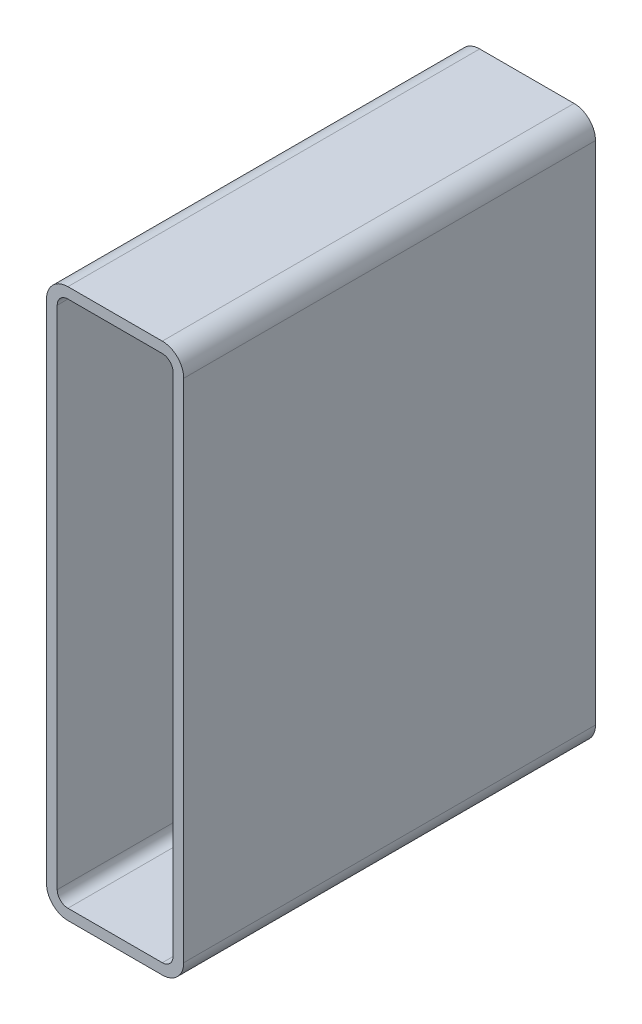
ISO-10303-21;
HEADER;
FILE_DESCRIPTION(('STEP AP214'),'2;1');
FILE_NAME('part.step','',(''),(''),'','','');
FILE_SCHEMA(('AUTOMOTIVE_DESIGN { 1 0 10303 214 1 1 1 1 }'));
ENDSEC;
DATA;
#1=APPLICATION_CONTEXT('core data for automotive mechanical design processes');
#2=APPLICATION_PROTOCOL_DEFINITION('international standard','automotive_design',2000,#1);
#3=PRODUCT_CONTEXT('',#1,'mechanical');
#4=PRODUCT('Part','Part','',(#3));
#5=PRODUCT_RELATED_PRODUCT_CATEGORY('part','',(#4));
#6=PRODUCT_DEFINITION_FORMATION('','',#4);
#7=PRODUCT_DEFINITION_CONTEXT('part definition',#1,'design');
#8=PRODUCT_DEFINITION('design','',#6,#7);
#9=PRODUCT_DEFINITION_SHAPE('','',#8);
#10=(LENGTH_UNIT() NAMED_UNIT(*) SI_UNIT(.MILLI.,.METRE.));
#11=(NAMED_UNIT(*) PLANE_ANGLE_UNIT() SI_UNIT($,.RADIAN.));
#12=(NAMED_UNIT(*) SI_UNIT($,.STERADIAN.) SOLID_ANGLE_UNIT());
#13=UNCERTAINTY_MEASURE_WITH_UNIT(LENGTH_MEASURE(1.E-05),#10,'distance_accuracy_value','');
#14=(GEOMETRIC_REPRESENTATION_CONTEXT(3) GLOBAL_UNCERTAINTY_ASSIGNED_CONTEXT((#13)) GLOBAL_UNIT_ASSIGNED_CONTEXT((#10,
#11,#12)) REPRESENTATION_CONTEXT('',''));
#15=CARTESIAN_POINT('',(0.,0.,0.));
#16=DIRECTION('',(0.,0.,1.));
#17=DIRECTION('',(1.,0.,0.));
#18=AXIS2_PLACEMENT_3D('',#15,#16,#17);
#19=CARTESIAN_POINT('',(17.5501778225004,392.307862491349,304.8));
#20=DIRECTION('',(0.,0.,1.));
#21=DIRECTION('',(1.,0.,0.));
#22=AXIS2_PLACEMENT_3D('',#19,#20,#21);
#23=PLANE('',#22);
#24=CARTESIAN_POINT('',(17.5501778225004,392.307862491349,304.8));
#25=DIRECTION('',(0.,0.,1.));
#26=DIRECTION('',(1.,0.,0.));
#27=AXIS2_PLACEMENT_3D('',#24,#25,#26);
#28=CIRCLE('',#27,15.875);
#29=CARTESIAN_POINT('',(17.5501778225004,408.182862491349,304.8));
#30=VERTEX_POINT('',#29);
#31=CARTESIAN_POINT('',(1.67517782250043,392.307862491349,304.8));
#32=VERTEX_POINT('',#31);
#33=EDGE_CURVE('E211',#30,#32,#28,.T.);
#34=ORIENTED_EDGE('',*,*,#33,.T.);
#35=DIRECTION('',(0.,-1.,0.));
#36=VECTOR('',#35,1.);
#37=CARTESIAN_POINT('',(1.67517782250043,17.6578624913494,304.8));
#38=LINE('',#37,#36);
#39=CARTESIAN_POINT('',(1.67517782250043,17.6578624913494,304.8));
#40=VERTEX_POINT('',#39);
#41=EDGE_CURVE('E214',#32,#40,#38,.T.);
#42=ORIENTED_EDGE('',*,*,#41,.T.);
#43=CARTESIAN_POINT('',(17.5501778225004,17.6578624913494,304.8));
#44=DIRECTION('',(0.,0.,1.));
#45=DIRECTION('',(1.,0.,0.));
#46=AXIS2_PLACEMENT_3D('',#43,#44,#45);
#47=CIRCLE('',#46,15.875);
#48=CARTESIAN_POINT('',(17.5501778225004,1.78286249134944,304.8));
#49=VERTEX_POINT('',#48);
#50=EDGE_CURVE('E217',#40,#49,#47,.T.);
#51=ORIENTED_EDGE('',*,*,#50,.T.);
#52=DIRECTION('',(1.,0.,0.));
#53=VECTOR('',#52,1.);
#54=CARTESIAN_POINT('',(87.4001778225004,1.78286249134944,304.8));
#55=LINE('',#54,#53);
#56=CARTESIAN_POINT('',(87.4001778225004,1.78286249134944,304.8));
#57=VERTEX_POINT('',#56);
#58=EDGE_CURVE('E219',#49,#57,#55,.T.);
#59=ORIENTED_EDGE('',*,*,#58,.T.);
#60=CARTESIAN_POINT('',(87.4001778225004,17.6578624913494,304.8));
#61=DIRECTION('',(0.,0.,1.));
#62=DIRECTION('',(1.,0.,0.));
#63=AXIS2_PLACEMENT_3D('',#60,#61,#62);
#64=CIRCLE('',#63,15.875);
#65=CARTESIAN_POINT('',(103.2751778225,17.6578624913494,304.8));
#66=VERTEX_POINT('',#65);
#67=EDGE_CURVE('E221',#57,#66,#64,.T.);
#68=ORIENTED_EDGE('',*,*,#67,.T.);
#69=DIRECTION('',(0.,1.,0.));
#70=VECTOR('',#69,1.);
#71=CARTESIAN_POINT('',(103.2751778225,392.307862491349,304.8));
#72=LINE('',#71,#70);
#73=CARTESIAN_POINT('',(103.2751778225,392.307862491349,304.8));
#74=VERTEX_POINT('',#73);
#75=EDGE_CURVE('E223',#66,#74,#72,.T.);
#76=ORIENTED_EDGE('',*,*,#75,.T.);
#77=CARTESIAN_POINT('',(87.4001778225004,392.307862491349,304.8));
#78=DIRECTION('',(0.,0.,1.));
#79=DIRECTION('',(1.,0.,0.));
#80=AXIS2_PLACEMENT_3D('',#77,#78,#79);
#81=CIRCLE('',#80,15.875);
#82=CARTESIAN_POINT('',(87.4001778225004,408.182862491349,304.8));
#83=VERTEX_POINT('',#82);
#84=EDGE_CURVE('E225',#74,#83,#81,.T.);
#85=ORIENTED_EDGE('',*,*,#84,.T.);
#86=DIRECTION('',(-1.,0.,0.));
#87=VECTOR('',#86,1.);
#88=CARTESIAN_POINT('',(17.5501778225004,408.182862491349,304.8));
#89=LINE('',#88,#87);
#90=EDGE_CURVE('E227',#83,#30,#89,.T.);
#91=ORIENTED_EDGE('',*,*,#90,.T.);
#92=EDGE_LOOP('',(#34,#42,#51,#59,#68,#76,#85,#91));
#93=FACE_BOUND('',#92,.T.);
#94=DIRECTION('',(0.,-1.,0.));
#95=VECTOR('',#94,1.);
#96=CARTESIAN_POINT('',(9.61267782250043,17.6578624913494,304.8));
#97=LINE('',#96,#95);
#98=CARTESIAN_POINT('',(9.61267782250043,392.307862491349,304.8));
#99=VERTEX_POINT('',#98);
#100=CARTESIAN_POINT('',(9.61267782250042,17.6578624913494,304.8));
#101=VERTEX_POINT('',#100);
#102=EDGE_CURVE('E154',#99,#101,#97,.T.);
#103=ORIENTED_EDGE('',*,*,#102,.F.);
#104=CARTESIAN_POINT('',(17.5501778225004,392.307862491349,304.8));
#105=DIRECTION('',(0.,0.,1.));
#106=DIRECTION('',(1.,0.,0.));
#107=AXIS2_PLACEMENT_3D('',#104,#105,#106);
#108=CIRCLE('',#107,7.93749999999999);
#109=CARTESIAN_POINT('',(17.5501778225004,400.245362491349,304.8));
#110=VERTEX_POINT('',#109);
#111=EDGE_CURVE('E146',#110,#99,#108,.T.);
#112=ORIENTED_EDGE('',*,*,#111,.F.);
#113=DIRECTION('',(-1.,0.,0.));
#114=VECTOR('',#113,1.);
#115=CARTESIAN_POINT('',(17.5501778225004,400.245362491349,304.8));
#116=LINE('',#115,#114);
#117=CARTESIAN_POINT('',(87.4001778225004,400.245362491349,304.8));
#118=VERTEX_POINT('',#117);
#119=EDGE_CURVE('E179',#118,#110,#116,.T.);
#120=ORIENTED_EDGE('',*,*,#119,.F.);
#121=CARTESIAN_POINT('',(87.4001778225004,392.307862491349,304.8));
#122=DIRECTION('',(0.,0.,1.));
#123=DIRECTION('',(1.,0.,0.));
#124=AXIS2_PLACEMENT_3D('',#121,#122,#123);
#125=CIRCLE('',#124,7.93749999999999);
#126=CARTESIAN_POINT('',(95.3376778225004,392.307862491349,304.8));
#127=VERTEX_POINT('',#126);
#128=EDGE_CURVE('E177',#127,#118,#125,.T.);
#129=ORIENTED_EDGE('',*,*,#128,.F.);
#130=DIRECTION('',(0.,1.,0.));
#131=VECTOR('',#130,1.);
#132=CARTESIAN_POINT('',(95.3376778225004,392.307862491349,304.8));
#133=LINE('',#132,#131);
#134=CARTESIAN_POINT('',(95.3376778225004,17.6578624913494,304.8));
#135=VERTEX_POINT('',#134);
#136=EDGE_CURVE('E175',#135,#127,#133,.T.);
#137=ORIENTED_EDGE('',*,*,#136,.F.);
#138=CARTESIAN_POINT('',(87.4001778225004,17.6578624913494,304.8));
#139=DIRECTION('',(0.,0.,1.));
#140=DIRECTION('',(1.,0.,0.));
#141=AXIS2_PLACEMENT_3D('',#138,#139,#140);
#142=CIRCLE('',#141,7.9375);
#143=CARTESIAN_POINT('',(87.4001778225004,9.72036249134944,304.8));
#144=VERTEX_POINT('',#143);
#145=EDGE_CURVE('E173',#144,#135,#142,.T.);
#146=ORIENTED_EDGE('',*,*,#145,.F.);
#147=DIRECTION('',(1.,0.,0.));
#148=VECTOR('',#147,1.);
#149=CARTESIAN_POINT('',(87.4001778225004,9.72036249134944,304.8));
#150=LINE('',#149,#148);
#151=CARTESIAN_POINT('',(17.5501778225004,9.72036249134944,304.8));
#152=VERTEX_POINT('',#151);
#153=EDGE_CURVE('E169',#152,#144,#150,.T.);
#154=ORIENTED_EDGE('',*,*,#153,.F.);
#155=CARTESIAN_POINT('',(17.5501778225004,17.6578624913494,304.8));
#156=DIRECTION('',(0.,0.,1.));
#157=DIRECTION('',(1.,0.,0.));
#158=AXIS2_PLACEMENT_3D('',#155,#156,#157);
#159=CIRCLE('',#158,7.9375);
#160=EDGE_CURVE('E167',#101,#152,#159,.T.);
#161=ORIENTED_EDGE('',*,*,#160,.F.);
#162=EDGE_LOOP('',(#103,#112,#120,#129,#137,#146,#154,#161));
#163=FACE_BOUND('',#162,.T.);
#164=ADVANCED_FACE('F33',(#93,#163),#23,.T.);
#165=CARTESIAN_POINT('',(17.5501778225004,392.307862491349,0.));
#166=DIRECTION('',(0.,0.,1.));
#167=DIRECTION('',(1.,0.,0.));
#168=AXIS2_PLACEMENT_3D('',#165,#166,#167);
#169=PLANE('',#168);
#170=CARTESIAN_POINT('',(17.5501778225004,392.307862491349,0.));
#171=DIRECTION('',(0.,0.,1.));
#172=DIRECTION('',(1.,0.,0.));
#173=AXIS2_PLACEMENT_3D('',#170,#171,#172);
#174=CIRCLE('',#173,15.875);
#175=CARTESIAN_POINT('',(17.5501778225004,408.182862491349,0.));
#176=VERTEX_POINT('',#175);
#177=CARTESIAN_POINT('',(1.67517782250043,392.307862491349,0.));
#178=VERTEX_POINT('',#177);
#179=EDGE_CURVE('E162',#176,#178,#174,.T.);
#180=ORIENTED_EDGE('',*,*,#179,.F.);
#181=DIRECTION('',(-1.,0.,0.));
#182=VECTOR('',#181,1.);
#183=CARTESIAN_POINT('',(17.5501778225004,408.182862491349,0.));
#184=LINE('',#183,#182);
#185=CARTESIAN_POINT('',(87.4001778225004,408.182862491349,0.));
#186=VERTEX_POINT('',#185);
#187=EDGE_CURVE('E215',#186,#176,#184,.T.);
#188=ORIENTED_EDGE('',*,*,#187,.F.);
#189=CARTESIAN_POINT('',(87.4001778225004,392.307862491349,0.));
#190=DIRECTION('',(0.,0.,1.));
#191=DIRECTION('',(1.,0.,0.));
#192=AXIS2_PLACEMENT_3D('',#189,#190,#191);
#193=CIRCLE('',#192,15.875);
#194=CARTESIAN_POINT('',(103.2751778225,392.307862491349,0.));
#195=VERTEX_POINT('',#194);
#196=EDGE_CURVE('E242',#195,#186,#193,.T.);
#197=ORIENTED_EDGE('',*,*,#196,.F.);
#198=DIRECTION('',(0.,1.,0.));
#199=VECTOR('',#198,1.);
#200=CARTESIAN_POINT('',(103.2751778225,392.307862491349,0.));
#201=LINE('',#200,#199);
#202=CARTESIAN_POINT('',(103.2751778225,17.6578624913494,0.));
#203=VERTEX_POINT('',#202);
#204=EDGE_CURVE('E240',#203,#195,#201,.T.);
#205=ORIENTED_EDGE('',*,*,#204,.F.);
#206=CARTESIAN_POINT('',(87.4001778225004,17.6578624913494,0.));
#207=DIRECTION('',(0.,0.,1.));
#208=DIRECTION('',(1.,0.,0.));
#209=AXIS2_PLACEMENT_3D('',#206,#207,#208);
#210=CIRCLE('',#209,15.875);
#211=CARTESIAN_POINT('',(87.4001778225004,1.78286249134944,0.));
#212=VERTEX_POINT('',#211);
#213=EDGE_CURVE('E238',#212,#203,#210,.T.);
#214=ORIENTED_EDGE('',*,*,#213,.F.);
#215=DIRECTION('',(1.,0.,0.));
#216=VECTOR('',#215,1.);
#217=CARTESIAN_POINT('',(87.4001778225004,1.78286249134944,0.));
#218=LINE('',#217,#216);
#219=CARTESIAN_POINT('',(17.5501778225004,1.78286249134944,0.));
#220=VERTEX_POINT('',#219);
#221=EDGE_CURVE('E236',#220,#212,#218,.T.);
#222=ORIENTED_EDGE('',*,*,#221,.F.);
#223=CARTESIAN_POINT('',(17.5501778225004,17.6578624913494,0.));
#224=DIRECTION('',(0.,0.,1.));
#225=DIRECTION('',(1.,0.,0.));
#226=AXIS2_PLACEMENT_3D('',#223,#224,#225);
#227=CIRCLE('',#226,15.875);
#228=CARTESIAN_POINT('',(1.67517782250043,17.6578624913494,0.));
#229=VERTEX_POINT('',#228);
#230=EDGE_CURVE('E234',#229,#220,#227,.T.);
#231=ORIENTED_EDGE('',*,*,#230,.F.);
#232=DIRECTION('',(0.,-1.,0.));
#233=VECTOR('',#232,1.);
#234=CARTESIAN_POINT('',(1.67517782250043,17.6578624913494,0.));
#235=LINE('',#234,#233);
#236=EDGE_CURVE('E232',#178,#229,#235,.T.);
#237=ORIENTED_EDGE('',*,*,#236,.F.);
#238=EDGE_LOOP('',(#180,#188,#197,#205,#214,#222,#231,#237));
#239=FACE_BOUND('',#238,.T.);
#240=CARTESIAN_POINT('',(17.5501778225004,392.307862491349,0.));
#241=DIRECTION('',(0.,0.,1.));
#242=DIRECTION('',(1.,0.,0.));
#243=AXIS2_PLACEMENT_3D('',#240,#241,#242);
#244=CIRCLE('',#243,7.93749999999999);
#245=CARTESIAN_POINT('',(17.5501778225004,400.245362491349,0.));
#246=VERTEX_POINT('',#245);
#247=CARTESIAN_POINT('',(9.61267782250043,392.307862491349,0.));
#248=VERTEX_POINT('',#247);
#249=EDGE_CURVE('E56',#246,#248,#244,.T.);
#250=ORIENTED_EDGE('',*,*,#249,.T.);
#251=DIRECTION('',(0.,-1.,0.));
#252=VECTOR('',#251,1.);
#253=CARTESIAN_POINT('',(9.61267782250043,17.6578624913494,0.));
#254=LINE('',#253,#252);
#255=CARTESIAN_POINT('',(9.61267782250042,17.6578624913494,0.));
#256=VERTEX_POINT('',#255);
#257=EDGE_CURVE('E161',#248,#256,#254,.T.);
#258=ORIENTED_EDGE('',*,*,#257,.T.);
#259=CARTESIAN_POINT('',(17.5501778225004,17.6578624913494,0.));
#260=DIRECTION('',(0.,0.,1.));
#261=DIRECTION('',(1.,0.,0.));
#262=AXIS2_PLACEMENT_3D('',#259,#260,#261);
#263=CIRCLE('',#262,7.9375);
#264=CARTESIAN_POINT('',(17.5501778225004,9.72036249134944,0.));
#265=VERTEX_POINT('',#264);
#266=EDGE_CURVE('E183',#256,#265,#263,.T.);
#267=ORIENTED_EDGE('',*,*,#266,.T.);
#268=DIRECTION('',(1.,0.,0.));
#269=VECTOR('',#268,1.);
#270=CARTESIAN_POINT('',(87.4001778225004,9.72036249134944,0.));
#271=LINE('',#270,#269);
#272=CARTESIAN_POINT('',(87.4001778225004,9.72036249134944,0.));
#273=VERTEX_POINT('',#272);
#274=EDGE_CURVE('E186',#265,#273,#271,.T.);
#275=ORIENTED_EDGE('',*,*,#274,.T.);
#276=CARTESIAN_POINT('',(87.4001778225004,17.6578624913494,0.));
#277=DIRECTION('',(0.,0.,1.));
#278=DIRECTION('',(1.,0.,0.));
#279=AXIS2_PLACEMENT_3D('',#276,#277,#278);
#280=CIRCLE('',#279,7.9375);
#281=CARTESIAN_POINT('',(95.3376778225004,17.6578624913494,0.));
#282=VERTEX_POINT('',#281);
#283=EDGE_CURVE('E189',#273,#282,#280,.T.);
#284=ORIENTED_EDGE('',*,*,#283,.T.);
#285=DIRECTION('',(0.,1.,0.));
#286=VECTOR('',#285,1.);
#287=CARTESIAN_POINT('',(95.3376778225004,392.307862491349,0.));
#288=LINE('',#287,#286);
#289=CARTESIAN_POINT('',(95.3376778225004,392.307862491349,0.));
#290=VERTEX_POINT('',#289);
#291=EDGE_CURVE('E192',#282,#290,#288,.T.);
#292=ORIENTED_EDGE('',*,*,#291,.T.);
#293=CARTESIAN_POINT('',(87.4001778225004,392.307862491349,0.));
#294=DIRECTION('',(0.,0.,1.));
#295=DIRECTION('',(1.,0.,0.));
#296=AXIS2_PLACEMENT_3D('',#293,#294,#295);
#297=CIRCLE('',#296,7.93749999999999);
#298=CARTESIAN_POINT('',(87.4001778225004,400.245362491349,0.));
#299=VERTEX_POINT('',#298);
#300=EDGE_CURVE('E195',#290,#299,#297,.T.);
#301=ORIENTED_EDGE('',*,*,#300,.T.);
#302=DIRECTION('',(-1.,0.,0.));
#303=VECTOR('',#302,1.);
#304=CARTESIAN_POINT('',(17.5501778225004,400.245362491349,0.));
#305=LINE('',#304,#303);
#306=EDGE_CURVE('E155',#299,#246,#305,.T.);
#307=ORIENTED_EDGE('',*,*,#306,.T.);
#308=EDGE_LOOP('',(#250,#258,#267,#275,#284,#292,#301,#307));
#309=FACE_BOUND('',#308,.T.);
#310=ADVANCED_FACE('F272',(#239,#309),#169,.F.);
#311=CARTESIAN_POINT('',(17.5501778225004,392.307862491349,304.8));
#312=DIRECTION('',(0.,0.,-1.));
#313=DIRECTION('',(-1.,0.,0.));
#314=AXIS2_PLACEMENT_3D('',#311,#312,#313);
#315=CYLINDRICAL_SURFACE('',#314,15.875);
#316=ORIENTED_EDGE('',*,*,#179,.T.);
#317=DIRECTION('',(0.,0.,-1.));
#318=VECTOR('',#317,1.);
#319=CARTESIAN_POINT('',(1.67517782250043,392.307862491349,304.8));
#320=LINE('',#319,#318);
#321=EDGE_CURVE('E11',#32,#178,#320,.T.);
#322=ORIENTED_EDGE('',*,*,#321,.F.);
#323=ORIENTED_EDGE('',*,*,#33,.F.);
#324=DIRECTION('',(0.,0.,-1.));
#325=VECTOR('',#324,1.);
#326=CARTESIAN_POINT('',(17.5501778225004,408.182862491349,304.8));
#327=LINE('',#326,#325);
#328=EDGE_CURVE('E229',#30,#176,#327,.T.);
#329=ORIENTED_EDGE('',*,*,#328,.T.);
#330=EDGE_LOOP('',(#316,#322,#323,#329));
#331=FACE_BOUND('',#330,.T.);
#332=ADVANCED_FACE('F35',(#331),#315,.T.);
#333=CARTESIAN_POINT('',(1.67517782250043,17.6578624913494,304.8));
#334=DIRECTION('',(1.,0.,0.));
#335=DIRECTION('',(0.,0.,-1.));
#336=AXIS2_PLACEMENT_3D('',#333,#334,#335);
#337=PLANE('',#336);
#338=ORIENTED_EDGE('',*,*,#236,.T.);
#339=DIRECTION('',(0.,0.,-1.));
#340=VECTOR('',#339,1.);
#341=CARTESIAN_POINT('',(1.67517782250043,17.6578624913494,304.8));
#342=LINE('',#341,#340);
#343=EDGE_CURVE('E41',#40,#229,#342,.T.);
#344=ORIENTED_EDGE('',*,*,#343,.F.);
#345=ORIENTED_EDGE('',*,*,#41,.F.);
#346=ORIENTED_EDGE('',*,*,#321,.T.);
#347=EDGE_LOOP('',(#338,#344,#345,#346));
#348=FACE_BOUND('',#347,.T.);
#349=ADVANCED_FACE('F289',(#348),#337,.F.);
#350=CARTESIAN_POINT('',(17.5501778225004,17.6578624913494,304.8));
#351=DIRECTION('',(0.,0.,-1.));
#352=DIRECTION('',(-1.,0.,0.));
#353=AXIS2_PLACEMENT_3D('',#350,#351,#352);
#354=CYLINDRICAL_SURFACE('',#353,15.875);
#355=ORIENTED_EDGE('',*,*,#230,.T.);
#356=DIRECTION('',(0.,0.,-1.));
#357=VECTOR('',#356,1.);
#358=CARTESIAN_POINT('',(17.5501778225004,1.78286249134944,304.8));
#359=LINE('',#358,#357);
#360=EDGE_CURVE('E259',#49,#220,#359,.T.);
#361=ORIENTED_EDGE('',*,*,#360,.F.);
#362=ORIENTED_EDGE('',*,*,#50,.F.);
#363=ORIENTED_EDGE('',*,*,#343,.T.);
#364=EDGE_LOOP('',(#355,#361,#362,#363));
#365=FACE_BOUND('',#364,.T.);
#366=ADVANCED_FACE('F266',(#365),#354,.T.);
#367=CARTESIAN_POINT('',(87.4001778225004,1.78286249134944,304.8));
#368=DIRECTION('',(0.,1.,0.));
#369=DIRECTION('',(0.,0.,1.));
#370=AXIS2_PLACEMENT_3D('',#367,#368,#369);
#371=PLANE('',#370);
#372=ORIENTED_EDGE('',*,*,#221,.T.);
#373=DIRECTION('',(0.,0.,-1.));
#374=VECTOR('',#373,1.);
#375=CARTESIAN_POINT('',(87.4001778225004,1.78286249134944,304.8));
#376=LINE('',#375,#374);
#377=EDGE_CURVE('E256',#57,#212,#376,.T.);
#378=ORIENTED_EDGE('',*,*,#377,.F.);
#379=ORIENTED_EDGE('',*,*,#58,.F.);
#380=ORIENTED_EDGE('',*,*,#360,.T.);
#381=EDGE_LOOP('',(#372,#378,#379,#380));
#382=FACE_BOUND('',#381,.T.);
#383=ADVANCED_FACE('F278',(#382),#371,.F.);
#384=CARTESIAN_POINT('',(87.4001778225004,17.6578624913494,304.8));
#385=DIRECTION('',(0.,0.,-1.));
#386=DIRECTION('',(-1.,0.,0.));
#387=AXIS2_PLACEMENT_3D('',#384,#385,#386);
#388=CYLINDRICAL_SURFACE('',#387,15.875);
#389=ORIENTED_EDGE('',*,*,#213,.T.);
#390=DIRECTION('',(0.,0.,-1.));
#391=VECTOR('',#390,1.);
#392=CARTESIAN_POINT('',(103.2751778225,17.6578624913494,304.8));
#393=LINE('',#392,#391);
#394=EDGE_CURVE('E253',#66,#203,#393,.T.);
#395=ORIENTED_EDGE('',*,*,#394,.F.);
#396=ORIENTED_EDGE('',*,*,#67,.F.);
#397=ORIENTED_EDGE('',*,*,#377,.T.);
#398=EDGE_LOOP('',(#389,#395,#396,#397));
#399=FACE_BOUND('',#398,.T.);
#400=ADVANCED_FACE('F282',(#399),#388,.T.);
#401=CARTESIAN_POINT('',(103.2751778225,392.307862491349,304.8));
#402=DIRECTION('',(-1.,0.,0.));
#403=DIRECTION('',(0.,0.,1.));
#404=AXIS2_PLACEMENT_3D('',#401,#402,#403);
#405=PLANE('',#404);
#406=ORIENTED_EDGE('',*,*,#204,.T.);
#407=DIRECTION('',(0.,0.,-1.));
#408=VECTOR('',#407,1.);
#409=CARTESIAN_POINT('',(103.2751778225,392.307862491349,304.8));
#410=LINE('',#409,#408);
#411=EDGE_CURVE('E250',#74,#195,#410,.T.);
#412=ORIENTED_EDGE('',*,*,#411,.F.);
#413=ORIENTED_EDGE('',*,*,#75,.F.);
#414=ORIENTED_EDGE('',*,*,#394,.T.);
#415=EDGE_LOOP('',(#406,#412,#413,#414));
#416=FACE_BOUND('',#415,.T.);
#417=ADVANCED_FACE('F302',(#416),#405,.F.);
#418=CARTESIAN_POINT('',(87.4001778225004,392.307862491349,304.8));
#419=DIRECTION('',(0.,0.,-1.));
#420=DIRECTION('',(-1.,0.,0.));
#421=AXIS2_PLACEMENT_3D('',#418,#419,#420);
#422=CYLINDRICAL_SURFACE('',#421,15.875);
#423=ORIENTED_EDGE('',*,*,#196,.T.);
#424=DIRECTION('',(0.,0.,-1.));
#425=VECTOR('',#424,1.);
#426=CARTESIAN_POINT('',(87.4001778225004,408.182862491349,304.8));
#427=LINE('',#426,#425);
#428=EDGE_CURVE('E247',#83,#186,#427,.T.);
#429=ORIENTED_EDGE('',*,*,#428,.F.);
#430=ORIENTED_EDGE('',*,*,#84,.F.);
#431=ORIENTED_EDGE('',*,*,#411,.T.);
#432=EDGE_LOOP('',(#423,#429,#430,#431));
#433=FACE_BOUND('',#432,.T.);
#434=ADVANCED_FACE('F300',(#433),#422,.T.);
#435=CARTESIAN_POINT('',(17.5501778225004,408.182862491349,304.8));
#436=DIRECTION('',(0.,-1.,0.));
#437=DIRECTION('',(0.,0.,-1.));
#438=AXIS2_PLACEMENT_3D('',#435,#436,#437);
#439=PLANE('',#438);
#440=ORIENTED_EDGE('',*,*,#187,.T.);
#441=ORIENTED_EDGE('',*,*,#328,.F.);
#442=ORIENTED_EDGE('',*,*,#90,.F.);
#443=ORIENTED_EDGE('',*,*,#428,.T.);
#444=EDGE_LOOP('',(#440,#441,#442,#443));
#445=FACE_BOUND('',#444,.T.);
#446=ADVANCED_FACE('F295',(#445),#439,.F.);
#447=CARTESIAN_POINT('',(17.5501778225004,392.307862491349,304.8));
#448=DIRECTION('',(0.,0.,-1.));
#449=DIRECTION('',(-1.,0.,0.));
#450=AXIS2_PLACEMENT_3D('',#447,#448,#449);
#451=CYLINDRICAL_SURFACE('',#450,7.93749999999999);
#452=ORIENTED_EDGE('',*,*,#249,.F.);
#453=DIRECTION('',(0.,0.,-1.));
#454=VECTOR('',#453,1.);
#455=CARTESIAN_POINT('',(17.5501778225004,400.245362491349,304.8));
#456=LINE('',#455,#454);
#457=EDGE_CURVE('E150',#110,#246,#456,.T.);
#458=ORIENTED_EDGE('',*,*,#457,.F.);
#459=ORIENTED_EDGE('',*,*,#111,.T.);
#460=DIRECTION('',(0.,0.,-1.));
#461=VECTOR('',#460,1.);
#462=CARTESIAN_POINT('',(9.61267782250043,392.307862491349,304.8));
#463=LINE('',#462,#461);
#464=EDGE_CURVE('E149',#99,#248,#463,.T.);
#465=ORIENTED_EDGE('',*,*,#464,.T.);
#466=EDGE_LOOP('',(#452,#458,#459,#465));
#467=FACE_BOUND('',#466,.T.);
#468=ADVANCED_FACE('F148',(#467),#451,.F.);
#469=CARTESIAN_POINT('',(9.61267782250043,17.6578624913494,304.8));
#470=DIRECTION('',(1.,0.,0.));
#471=DIRECTION('',(0.,0.,-1.));
#472=AXIS2_PLACEMENT_3D('',#469,#470,#471);
#473=PLANE('',#472);
#474=ORIENTED_EDGE('',*,*,#257,.F.);
#475=ORIENTED_EDGE('',*,*,#464,.F.);
#476=ORIENTED_EDGE('',*,*,#102,.T.);
#477=DIRECTION('',(0.,0.,-1.));
#478=VECTOR('',#477,1.);
#479=CARTESIAN_POINT('',(9.61267782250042,17.6578624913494,304.8));
#480=LINE('',#479,#478);
#481=EDGE_CURVE('E163',#101,#256,#480,.T.);
#482=ORIENTED_EDGE('',*,*,#481,.T.);
#483=EDGE_LOOP('',(#474,#475,#476,#482));
#484=FACE_BOUND('',#483,.T.);
#485=ADVANCED_FACE('F158',(#484),#473,.T.);
#486=CARTESIAN_POINT('',(17.5501778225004,17.6578624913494,304.8));
#487=DIRECTION('',(0.,0.,-1.));
#488=DIRECTION('',(-1.,0.,0.));
#489=AXIS2_PLACEMENT_3D('',#486,#487,#488);
#490=CYLINDRICAL_SURFACE('',#489,7.9375);
#491=ORIENTED_EDGE('',*,*,#266,.F.);
#492=ORIENTED_EDGE('',*,*,#481,.F.);
#493=ORIENTED_EDGE('',*,*,#160,.T.);
#494=DIRECTION('',(0.,0.,-1.));
#495=VECTOR('',#494,1.);
#496=CARTESIAN_POINT('',(17.5501778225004,9.72036249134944,304.8));
#497=LINE('',#496,#495);
#498=EDGE_CURVE('E208',#152,#265,#497,.T.);
#499=ORIENTED_EDGE('',*,*,#498,.T.);
#500=EDGE_LOOP('',(#491,#492,#493,#499));
#501=FACE_BOUND('',#500,.T.);
#502=ADVANCED_FACE('F327',(#501),#490,.F.);
#503=CARTESIAN_POINT('',(87.4001778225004,9.72036249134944,304.8));
#504=DIRECTION('',(0.,1.,0.));
#505=DIRECTION('',(0.,0.,1.));
#506=AXIS2_PLACEMENT_3D('',#503,#504,#505);
#507=PLANE('',#506);
#508=ORIENTED_EDGE('',*,*,#274,.F.);
#509=ORIENTED_EDGE('',*,*,#498,.F.);
#510=ORIENTED_EDGE('',*,*,#153,.T.);
#511=DIRECTION('',(0.,0.,-1.));
#512=VECTOR('',#511,1.);
#513=CARTESIAN_POINT('',(87.4001778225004,9.72036249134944,304.8));
#514=LINE('',#513,#512);
#515=EDGE_CURVE('E206',#144,#273,#514,.T.);
#516=ORIENTED_EDGE('',*,*,#515,.T.);
#517=EDGE_LOOP('',(#508,#509,#510,#516));
#518=FACE_BOUND('',#517,.T.);
#519=ADVANCED_FACE('F331',(#518),#507,.T.);
#520=CARTESIAN_POINT('',(87.4001778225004,17.6578624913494,304.8));
#521=DIRECTION('',(0.,0.,-1.));
#522=DIRECTION('',(-1.,0.,0.));
#523=AXIS2_PLACEMENT_3D('',#520,#521,#522);
#524=CYLINDRICAL_SURFACE('',#523,7.9375);
#525=ORIENTED_EDGE('',*,*,#283,.F.);
#526=ORIENTED_EDGE('',*,*,#515,.F.);
#527=ORIENTED_EDGE('',*,*,#145,.T.);
#528=DIRECTION('',(0.,0.,-1.));
#529=VECTOR('',#528,1.);
#530=CARTESIAN_POINT('',(95.3376778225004,17.6578624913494,304.8));
#531=LINE('',#530,#529);
#532=EDGE_CURVE('E204',#135,#282,#531,.T.);
#533=ORIENTED_EDGE('',*,*,#532,.T.);
#534=EDGE_LOOP('',(#525,#526,#527,#533));
#535=FACE_BOUND('',#534,.T.);
#536=ADVANCED_FACE('F337',(#535),#524,.F.);
#537=CARTESIAN_POINT('',(95.3376778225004,392.307862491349,304.8));
#538=DIRECTION('',(-1.,0.,0.));
#539=DIRECTION('',(0.,0.,1.));
#540=AXIS2_PLACEMENT_3D('',#537,#538,#539);
#541=PLANE('',#540);
#542=ORIENTED_EDGE('',*,*,#291,.F.);
#543=ORIENTED_EDGE('',*,*,#532,.F.);
#544=ORIENTED_EDGE('',*,*,#136,.T.);
#545=DIRECTION('',(0.,0.,-1.));
#546=VECTOR('',#545,1.);
#547=CARTESIAN_POINT('',(95.3376778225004,392.307862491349,304.8));
#548=LINE('',#547,#546);
#549=EDGE_CURVE('E202',#127,#290,#548,.T.);
#550=ORIENTED_EDGE('',*,*,#549,.T.);
#551=EDGE_LOOP('',(#542,#543,#544,#550));
#552=FACE_BOUND('',#551,.T.);
#553=ADVANCED_FACE('F341',(#552),#541,.T.);
#554=CARTESIAN_POINT('',(87.4001778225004,392.307862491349,304.8));
#555=DIRECTION('',(0.,0.,-1.));
#556=DIRECTION('',(-1.,0.,0.));
#557=AXIS2_PLACEMENT_3D('',#554,#555,#556);
#558=CYLINDRICAL_SURFACE('',#557,7.93749999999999);
#559=ORIENTED_EDGE('',*,*,#300,.F.);
#560=ORIENTED_EDGE('',*,*,#549,.F.);
#561=ORIENTED_EDGE('',*,*,#128,.T.);
#562=DIRECTION('',(0.,0.,-1.));
#563=VECTOR('',#562,1.);
#564=CARTESIAN_POINT('',(87.4001778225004,400.245362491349,304.8));
#565=LINE('',#564,#563);
#566=EDGE_CURVE('E48',#118,#299,#565,.T.);
#567=ORIENTED_EDGE('',*,*,#566,.T.);
#568=EDGE_LOOP('',(#559,#560,#561,#567));
#569=FACE_BOUND('',#568,.T.);
#570=ADVANCED_FACE('F345',(#569),#558,.F.);
#571=CARTESIAN_POINT('',(17.5501778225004,400.245362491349,304.8));
#572=DIRECTION('',(0.,-1.,0.));
#573=DIRECTION('',(0.,0.,-1.));
#574=AXIS2_PLACEMENT_3D('',#571,#572,#573);
#575=PLANE('',#574);
#576=ORIENTED_EDGE('',*,*,#306,.F.);
#577=ORIENTED_EDGE('',*,*,#566,.F.);
#578=ORIENTED_EDGE('',*,*,#119,.T.);
#579=ORIENTED_EDGE('',*,*,#457,.T.);
#580=EDGE_LOOP('',(#576,#577,#578,#579));
#581=FACE_BOUND('',#580,.T.);
#582=ADVANCED_FACE('F349',(#581),#575,.T.);
#583=CLOSED_SHELL('',(#164,#310,#332,#349,#366,#383,#400,#417,#434,#446,#468,#485,#502,#519,
#536,#553,#570,#582));
#584=MANIFOLD_SOLID_BREP('B2',#583);
#585=ADVANCED_BREP_SHAPE_REPRESENTATION('',(#18,#584),#14);
#586=SHAPE_DEFINITION_REPRESENTATION(#9,#585);
ENDSEC;
END-ISO-10303-21;
